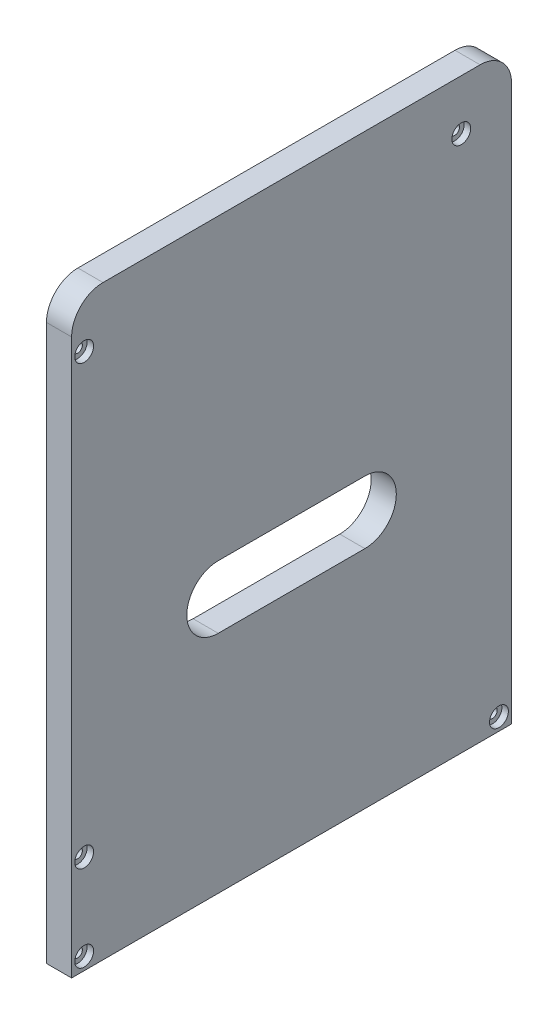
ISO-10303-21;
HEADER;
FILE_DESCRIPTION(('STEP AP214'),'2;1');
FILE_NAME('part.step','',(''),(''),'','','');
FILE_SCHEMA(('AUTOMOTIVE_DESIGN { 1 0 10303 214 1 1 1 1 }'));
ENDSEC;
DATA;
#1=APPLICATION_CONTEXT('core data for automotive mechanical design processes');
#2=APPLICATION_PROTOCOL_DEFINITION('international standard','automotive_design',2000,#1);
#3=PRODUCT_CONTEXT('',#1,'mechanical');
#4=PRODUCT('Part','Part','',(#3));
#5=PRODUCT_RELATED_PRODUCT_CATEGORY('part','',(#4));
#6=PRODUCT_DEFINITION_FORMATION('','',#4);
#7=PRODUCT_DEFINITION_CONTEXT('part definition',#1,'design');
#8=PRODUCT_DEFINITION('design','',#6,#7);
#9=PRODUCT_DEFINITION_SHAPE('','',#8);
#10=(LENGTH_UNIT() NAMED_UNIT(*) SI_UNIT(.MILLI.,.METRE.));
#11=(NAMED_UNIT(*) PLANE_ANGLE_UNIT() SI_UNIT($,.RADIAN.));
#12=(NAMED_UNIT(*) SI_UNIT($,.STERADIAN.) SOLID_ANGLE_UNIT());
#13=UNCERTAINTY_MEASURE_WITH_UNIT(LENGTH_MEASURE(1.E-05),#10,'distance_accuracy_value','');
#14=(GEOMETRIC_REPRESENTATION_CONTEXT(3) GLOBAL_UNCERTAINTY_ASSIGNED_CONTEXT((#13)) GLOBAL_UNIT_ASSIGNED_CONTEXT((#10,
#11,#12)) REPRESENTATION_CONTEXT('',''));
#15=CARTESIAN_POINT('',(0.,0.,0.));
#16=DIRECTION('',(0.,0.,1.));
#17=DIRECTION('',(1.,0.,0.));
#18=AXIS2_PLACEMENT_3D('',#15,#16,#17);
#19=CARTESIAN_POINT('',(228.,0.,0.));
#20=DIRECTION('',(-1.,0.,0.));
#21=DIRECTION('',(0.,0.,1.));
#22=AXIS2_PLACEMENT_3D('',#19,#20,#21);
#23=PLANE('',#22);
#24=CARTESIAN_POINT('',(228.,256.,99.));
#25=DIRECTION('',(-1.,0.,0.));
#26=DIRECTION('',(0.,0.,1.));
#27=AXIS2_PLACEMENT_3D('',#24,#25,#26);
#28=CIRCLE('',#27,2.24999999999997);
#29=CARTESIAN_POINT('',(228.,256.,101.25));
#30=VERTEX_POINT('',#29);
#31=EDGE_CURVE('E39',#30,#30,#28,.T.);
#32=ORIENTED_EDGE('',*,*,#31,.F.);
#33=EDGE_LOOP('',(#32));
#34=FACE_BOUND('',#33,.T.);
#35=CARTESIAN_POINT('',(228.,256.,-81.));
#36=DIRECTION('',(-1.,0.,0.));
#37=DIRECTION('',(0.,0.,1.));
#38=AXIS2_PLACEMENT_3D('',#35,#36,#37);
#39=CIRCLE('',#38,2.24999999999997);
#40=CARTESIAN_POINT('',(228.,256.,-78.7500000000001));
#41=VERTEX_POINT('',#40);
#42=EDGE_CURVE('E313',#41,#41,#39,.T.);
#43=ORIENTED_EDGE('',*,*,#42,.F.);
#44=EDGE_LOOP('',(#43));
#45=FACE_BOUND('',#44,.T.);
#46=CARTESIAN_POINT('',(228.,47.,98.9999999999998));
#47=DIRECTION('',(-1.,0.,0.));
#48=DIRECTION('',(0.,0.,1.));
#49=AXIS2_PLACEMENT_3D('',#46,#47,#48);
#50=CIRCLE('',#49,2.25);
#51=CARTESIAN_POINT('',(228.,47.,101.25));
#52=VERTEX_POINT('',#51);
#53=EDGE_CURVE('E309',#52,#52,#50,.T.);
#54=ORIENTED_EDGE('',*,*,#53,.F.);
#55=EDGE_LOOP('',(#54));
#56=FACE_BOUND('',#55,.T.);
#57=CARTESIAN_POINT('',(228.,6.,98.9999999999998));
#58=DIRECTION('',(-1.,0.,0.));
#59=DIRECTION('',(0.,0.,1.));
#60=AXIS2_PLACEMENT_3D('',#57,#58,#59);
#61=CIRCLE('',#60,2.25);
#62=CARTESIAN_POINT('',(228.,6.,101.25));
#63=VERTEX_POINT('',#62);
#64=EDGE_CURVE('E304',#63,#63,#61,.T.);
#65=ORIENTED_EDGE('',*,*,#64,.F.);
#66=EDGE_LOOP('',(#65));
#67=FACE_BOUND('',#66,.T.);
#68=CARTESIAN_POINT('',(228.,6.,-99.0000000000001));
#69=DIRECTION('',(-1.,0.,0.));
#70=DIRECTION('',(0.,0.,1.));
#71=AXIS2_PLACEMENT_3D('',#68,#69,#70);
#72=CIRCLE('',#71,2.25);
#73=CARTESIAN_POINT('',(228.,6.,-96.7500000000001));
#74=VERTEX_POINT('',#73);
#75=EDGE_CURVE('E300',#74,#74,#72,.T.);
#76=ORIENTED_EDGE('',*,*,#75,.F.);
#77=EDGE_LOOP('',(#76));
#78=FACE_BOUND('',#77,.T.);
#79=CARTESIAN_POINT('',(228.,122.5,34.9999999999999));
#80=DIRECTION('',(-1.,0.,0.));
#81=DIRECTION('',(0.,0.,1.));
#82=AXIS2_PLACEMENT_3D('',#79,#80,#81);
#83=CIRCLE('',#82,15.);
#84=CARTESIAN_POINT('',(228.,107.5,34.9999999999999));
#85=VERTEX_POINT('',#84);
#86=CARTESIAN_POINT('',(228.,137.5,34.9999999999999));
#87=VERTEX_POINT('',#86);
#88=EDGE_CURVE('E195',#85,#87,#83,.T.);
#89=ORIENTED_EDGE('',*,*,#88,.F.);
#90=DIRECTION('',(0.,0.,1.));
#91=VECTOR('',#90,1.);
#92=CARTESIAN_POINT('',(228.,107.5,0.));
#93=LINE('',#92,#91);
#94=CARTESIAN_POINT('',(228.,107.5,-35.0000000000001));
#95=VERTEX_POINT('',#94);
#96=EDGE_CURVE('E188',#95,#85,#93,.T.);
#97=ORIENTED_EDGE('',*,*,#96,.F.);
#98=CARTESIAN_POINT('',(228.,122.5,-35.0000000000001));
#99=DIRECTION('',(-1.,0.,0.));
#100=DIRECTION('',(0.,0.,1.));
#101=AXIS2_PLACEMENT_3D('',#98,#99,#100);
#102=CIRCLE('',#101,15.);
#103=CARTESIAN_POINT('',(228.,137.5,-35.0000000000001));
#104=VERTEX_POINT('',#103);
#105=EDGE_CURVE('E168',#104,#95,#102,.T.);
#106=ORIENTED_EDGE('',*,*,#105,.F.);
#107=DIRECTION('',(0.,0.,-1.));
#108=VECTOR('',#107,1.);
#109=CARTESIAN_POINT('',(228.,137.5,0.));
#110=LINE('',#109,#108);
#111=EDGE_CURVE('E193',#87,#104,#110,.T.);
#112=ORIENTED_EDGE('',*,*,#111,.F.);
#113=EDGE_LOOP('',(#89,#97,#106,#112));
#114=FACE_BOUND('',#113,.T.);
#115=CARTESIAN_POINT('',(228.,265.,-90.));
#116=DIRECTION('',(-1.,0.,0.));
#117=DIRECTION('',(0.,0.,1.));
#118=AXIS2_PLACEMENT_3D('',#115,#116,#117);
#119=CIRCLE('',#118,15.);
#120=CARTESIAN_POINT('',(228.,280.,-90.));
#121=VERTEX_POINT('',#120);
#122=CARTESIAN_POINT('',(228.,265.,-105.));
#123=VERTEX_POINT('',#122);
#124=EDGE_CURVE('E270',#121,#123,#119,.T.);
#125=ORIENTED_EDGE('',*,*,#124,.T.);
#126=DIRECTION('',(0.,1.,0.));
#127=VECTOR('',#126,1.);
#128=CARTESIAN_POINT('',(228.,0.,-105.));
#129=LINE('',#128,#127);
#130=CARTESIAN_POINT('',(228.,0.,-105.));
#131=VERTEX_POINT('',#130);
#132=EDGE_CURVE('E258',#131,#123,#129,.T.);
#133=ORIENTED_EDGE('',*,*,#132,.F.);
#134=DIRECTION('',(0.,0.,-1.));
#135=VECTOR('',#134,1.);
#136=CARTESIAN_POINT('',(228.,0.,105.));
#137=LINE('',#136,#135);
#138=CARTESIAN_POINT('',(228.,0.,105.));
#139=VERTEX_POINT('',#138);
#140=EDGE_CURVE('E256',#139,#131,#137,.T.);
#141=ORIENTED_EDGE('',*,*,#140,.F.);
#142=DIRECTION('',(0.,-1.,0.));
#143=VECTOR('',#142,1.);
#144=CARTESIAN_POINT('',(228.,0.,105.));
#145=LINE('',#144,#143);
#146=CARTESIAN_POINT('',(228.,265.,105.));
#147=VERTEX_POINT('',#146);
#148=EDGE_CURVE('E238',#147,#139,#145,.T.);
#149=ORIENTED_EDGE('',*,*,#148,.F.);
#150=CARTESIAN_POINT('',(228.,265.,90.));
#151=DIRECTION('',(-1.,0.,0.));
#152=DIRECTION('',(0.,0.,1.));
#153=AXIS2_PLACEMENT_3D('',#150,#151,#152);
#154=CIRCLE('',#153,15.);
#155=CARTESIAN_POINT('',(228.,280.,90.));
#156=VERTEX_POINT('',#155);
#157=EDGE_CURVE('E273',#147,#156,#154,.T.);
#158=ORIENTED_EDGE('',*,*,#157,.T.);
#159=DIRECTION('',(0.,0.,1.));
#160=VECTOR('',#159,1.);
#161=CARTESIAN_POINT('',(228.,280.,105.));
#162=LINE('',#161,#160);
#163=EDGE_CURVE('E246',#121,#156,#162,.T.);
#164=ORIENTED_EDGE('',*,*,#163,.F.);
#165=EDGE_LOOP('',(#125,#133,#141,#149,#158,#164));
#166=FACE_BOUND('',#165,.T.);
#167=DIRECTION('',(0.,0.,-1.));
#168=VECTOR('',#167,1.);
#169=CARTESIAN_POINT('',(228.,53.,0.));
#170=LINE('',#169,#168);
#171=CARTESIAN_POINT('',(228.,53.,93.));
#172=VERTEX_POINT('',#171);
#173=CARTESIAN_POINT('',(228.,53.,-85.));
#174=VERTEX_POINT('',#173);
#175=EDGE_CURVE('E291',#172,#174,#170,.T.);
#176=ORIENTED_EDGE('',*,*,#175,.T.);
#177=DIRECTION('',(0.,1.,0.));
#178=VECTOR('',#177,1.);
#179=CARTESIAN_POINT('',(228.,53.,-85.));
#180=LINE('',#179,#178);
#181=CARTESIAN_POINT('',(228.,65.,-85.));
#182=VERTEX_POINT('',#181);
#183=EDGE_CURVE('E235',#174,#182,#180,.T.);
#184=ORIENTED_EDGE('',*,*,#183,.T.);
#185=DIRECTION('',(0.,0.,-1.));
#186=VECTOR('',#185,1.);
#187=CARTESIAN_POINT('',(228.,65.,0.));
#188=LINE('',#187,#186);
#189=CARTESIAN_POINT('',(228.,65.,93.));
#190=VERTEX_POINT('',#189);
#191=EDGE_CURVE('E286',#190,#182,#188,.T.);
#192=ORIENTED_EDGE('',*,*,#191,.F.);
#193=DIRECTION('',(0.,1.,0.));
#194=VECTOR('',#193,1.);
#195=CARTESIAN_POINT('',(228.,0.,93.));
#196=LINE('',#195,#194);
#197=EDGE_CURVE('E288',#172,#190,#196,.T.);
#198=ORIENTED_EDGE('',*,*,#197,.F.);
#199=EDGE_LOOP('',(#176,#184,#192,#198));
#200=FACE_BOUND('',#199,.T.);
#201=DIRECTION('',(0.,1.,0.));
#202=VECTOR('',#201,1.);
#203=CARTESIAN_POINT('',(228.,0.,93.));
#204=LINE('',#203,#202);
#205=CARTESIAN_POINT('',(228.,210.,93.));
#206=VERTEX_POINT('',#205);
#207=CARTESIAN_POINT('',(228.,230.,93.));
#208=VERTEX_POINT('',#207);
#209=EDGE_CURVE('E296',#206,#208,#204,.T.);
#210=ORIENTED_EDGE('',*,*,#209,.F.);
#211=DIRECTION('',(0.,0.,-1.));
#212=VECTOR('',#211,1.);
#213=CARTESIAN_POINT('',(228.,210.,0.));
#214=LINE('',#213,#212);
#215=CARTESIAN_POINT('',(228.,210.,-75.));
#216=VERTEX_POINT('',#215);
#217=EDGE_CURVE('E11',#206,#216,#214,.T.);
#218=ORIENTED_EDGE('',*,*,#217,.T.);
#219=DIRECTION('',(0.,-1.,0.));
#220=VECTOR('',#219,1.);
#221=CARTESIAN_POINT('',(228.,0.,-75.));
#222=LINE('',#221,#220);
#223=CARTESIAN_POINT('',(228.,230.,-75.));
#224=VERTEX_POINT('',#223);
#225=EDGE_CURVE('E44',#224,#216,#222,.T.);
#226=ORIENTED_EDGE('',*,*,#225,.F.);
#227=DIRECTION('',(0.,0.,-1.));
#228=VECTOR('',#227,1.);
#229=CARTESIAN_POINT('',(228.,230.,0.));
#230=LINE('',#229,#228);
#231=EDGE_CURVE('E294',#208,#224,#230,.T.);
#232=ORIENTED_EDGE('',*,*,#231,.F.);
#233=EDGE_LOOP('',(#210,#218,#226,#232));
#234=FACE_BOUND('',#233,.T.);
#235=ADVANCED_FACE('F35',(#34,#45,#56,#67,#78,#114,#166,#200,#234),#23,.T.);
#236=CARTESIAN_POINT('',(240.,0.,105.));
#237=DIRECTION('',(0.,0.,-1.));
#238=DIRECTION('',(-1.,0.,0.));
#239=AXIS2_PLACEMENT_3D('',#236,#237,#238);
#240=PLANE('',#239);
#241=DIRECTION('',(0.,-1.,0.));
#242=VECTOR('',#241,1.);
#243=CARTESIAN_POINT('',(240.,0.,105.));
#244=LINE('',#243,#242);
#245=CARTESIAN_POINT('',(240.,265.,105.));
#246=VERTEX_POINT('',#245);
#247=CARTESIAN_POINT('',(240.,0.,105.));
#248=VERTEX_POINT('',#247);
#249=EDGE_CURVE('E243',#246,#248,#244,.T.);
#250=ORIENTED_EDGE('',*,*,#249,.F.);
#251=DIRECTION('',(-1.,0.,0.));
#252=VECTOR('',#251,1.);
#253=CARTESIAN_POINT('',(240.,265.,105.));
#254=LINE('',#253,#252);
#255=EDGE_CURVE('E267',#246,#147,#254,.T.);
#256=ORIENTED_EDGE('',*,*,#255,.T.);
#257=ORIENTED_EDGE('',*,*,#148,.T.);
#258=DIRECTION('',(-1.,0.,0.));
#259=VECTOR('',#258,1.);
#260=CARTESIAN_POINT('',(240.,0.,105.));
#261=LINE('',#260,#259);
#262=EDGE_CURVE('E264',#248,#139,#261,.T.);
#263=ORIENTED_EDGE('',*,*,#262,.F.);
#264=EDGE_LOOP('',(#250,#256,#257,#263));
#265=FACE_BOUND('',#264,.T.);
#266=ADVANCED_FACE('F384',(#265),#240,.F.);
#267=CARTESIAN_POINT('',(240.,0.,105.));
#268=DIRECTION('',(0.,1.,0.));
#269=DIRECTION('',(0.,0.,1.));
#270=AXIS2_PLACEMENT_3D('',#267,#268,#269);
#271=PLANE('',#270);
#272=ORIENTED_EDGE('',*,*,#140,.T.);
#273=DIRECTION('',(-1.,0.,0.));
#274=VECTOR('',#273,1.);
#275=CARTESIAN_POINT('',(240.,0.,-105.));
#276=LINE('',#275,#274);
#277=CARTESIAN_POINT('',(240.,0.,-105.));
#278=VERTEX_POINT('',#277);
#279=EDGE_CURVE('E254',#278,#131,#276,.T.);
#280=ORIENTED_EDGE('',*,*,#279,.F.);
#281=DIRECTION('',(0.,0.,-1.));
#282=VECTOR('',#281,1.);
#283=CARTESIAN_POINT('',(240.,0.,105.));
#284=LINE('',#283,#282);
#285=EDGE_CURVE('E245',#248,#278,#284,.T.);
#286=ORIENTED_EDGE('',*,*,#285,.F.);
#287=ORIENTED_EDGE('',*,*,#262,.T.);
#288=EDGE_LOOP('',(#272,#280,#286,#287));
#289=FACE_BOUND('',#288,.T.);
#290=ADVANCED_FACE('F389',(#289),#271,.F.);
#291=CARTESIAN_POINT('',(240.,0.,-105.));
#292=DIRECTION('',(0.,0.,1.));
#293=DIRECTION('',(1.,0.,0.));
#294=AXIS2_PLACEMENT_3D('',#291,#292,#293);
#295=PLANE('',#294);
#296=ORIENTED_EDGE('',*,*,#132,.T.);
#297=DIRECTION('',(-1.,0.,0.));
#298=VECTOR('',#297,1.);
#299=CARTESIAN_POINT('',(240.,265.,-105.));
#300=LINE('',#299,#298);
#301=CARTESIAN_POINT('',(240.,265.,-105.));
#302=VERTEX_POINT('',#301);
#303=EDGE_CURVE('E284',#123,#302,#300,.F.);
#304=ORIENTED_EDGE('',*,*,#303,.T.);
#305=DIRECTION('',(0.,1.,0.));
#306=VECTOR('',#305,1.);
#307=CARTESIAN_POINT('',(240.,0.,-105.));
#308=LINE('',#307,#306);
#309=EDGE_CURVE('E248',#278,#302,#308,.T.);
#310=ORIENTED_EDGE('',*,*,#309,.F.);
#311=ORIENTED_EDGE('',*,*,#279,.T.);
#312=EDGE_LOOP('',(#296,#304,#310,#311));
#313=FACE_BOUND('',#312,.T.);
#314=ADVANCED_FACE('F376',(#313),#295,.F.);
#315=CARTESIAN_POINT('',(240.,280.,105.));
#316=DIRECTION('',(0.,-1.,0.));
#317=DIRECTION('',(0.,0.,-1.));
#318=AXIS2_PLACEMENT_3D('',#315,#316,#317);
#319=PLANE('',#318);
#320=ORIENTED_EDGE('',*,*,#163,.T.);
#321=DIRECTION('',(-1.,0.,0.));
#322=VECTOR('',#321,1.);
#323=CARTESIAN_POINT('',(240.,280.,90.));
#324=LINE('',#323,#322);
#325=CARTESIAN_POINT('',(240.,280.,90.));
#326=VERTEX_POINT('',#325);
#327=EDGE_CURVE('E278',#156,#326,#324,.F.);
#328=ORIENTED_EDGE('',*,*,#327,.T.);
#329=DIRECTION('',(0.,0.,1.));
#330=VECTOR('',#329,1.);
#331=CARTESIAN_POINT('',(240.,280.,105.));
#332=LINE('',#331,#330);
#333=CARTESIAN_POINT('',(240.,280.,-90.));
#334=VERTEX_POINT('',#333);
#335=EDGE_CURVE('E251',#334,#326,#332,.T.);
#336=ORIENTED_EDGE('',*,*,#335,.F.);
#337=DIRECTION('',(-1.,0.,0.));
#338=VECTOR('',#337,1.);
#339=CARTESIAN_POINT('',(240.,280.,-90.));
#340=LINE('',#339,#338);
#341=EDGE_CURVE('E275',#334,#121,#340,.T.);
#342=ORIENTED_EDGE('',*,*,#341,.T.);
#343=EDGE_LOOP('',(#320,#328,#336,#342));
#344=FACE_BOUND('',#343,.T.);
#345=ADVANCED_FACE('F368',(#344),#319,.F.);
#346=CARTESIAN_POINT('',(240.,0.,0.));
#347=DIRECTION('',(-1.,0.,0.));
#348=DIRECTION('',(0.,0.,1.));
#349=AXIS2_PLACEMENT_3D('',#346,#347,#348);
#350=PLANE('',#349);
#351=CARTESIAN_POINT('',(240.,256.,99.));
#352=DIRECTION('',(1.,0.,0.));
#353=DIRECTION('',(0.,0.,-1.));
#354=AXIS2_PLACEMENT_3D('',#351,#352,#353);
#355=CIRCLE('',#354,4.5);
#356=CARTESIAN_POINT('',(240.,256.,94.5));
#357=VERTEX_POINT('',#356);
#358=EDGE_CURVE('E562',#357,#357,#355,.T.);
#359=ORIENTED_EDGE('',*,*,#358,.F.);
#360=EDGE_LOOP('',(#359));
#361=FACE_BOUND('',#360,.T.);
#362=CARTESIAN_POINT('',(240.,256.,-81.));
#363=DIRECTION('',(1.,0.,0.));
#364=DIRECTION('',(0.,0.,-1.));
#365=AXIS2_PLACEMENT_3D('',#362,#363,#364);
#366=CIRCLE('',#365,4.5);
#367=CARTESIAN_POINT('',(240.,256.,-85.5));
#368=VERTEX_POINT('',#367);
#369=EDGE_CURVE('E328',#368,#368,#366,.T.);
#370=ORIENTED_EDGE('',*,*,#369,.F.);
#371=EDGE_LOOP('',(#370));
#372=FACE_BOUND('',#371,.T.);
#373=CARTESIAN_POINT('',(240.,47.,98.9999999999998));
#374=DIRECTION('',(1.,0.,0.));
#375=DIRECTION('',(0.,0.,-1.));
#376=AXIS2_PLACEMENT_3D('',#373,#374,#375);
#377=CIRCLE('',#376,4.5);
#378=CARTESIAN_POINT('',(240.,47.,94.4999999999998));
#379=VERTEX_POINT('',#378);
#380=EDGE_CURVE('E315',#379,#379,#377,.T.);
#381=ORIENTED_EDGE('',*,*,#380,.F.);
#382=EDGE_LOOP('',(#381));
#383=FACE_BOUND('',#382,.T.);
#384=CARTESIAN_POINT('',(240.,6.,98.9999999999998));
#385=DIRECTION('',(1.,0.,0.));
#386=DIRECTION('',(0.,0.,-1.));
#387=AXIS2_PLACEMENT_3D('',#384,#385,#386);
#388=CIRCLE('',#387,4.5);
#389=CARTESIAN_POINT('',(240.,6.,94.4999999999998));
#390=VERTEX_POINT('',#389);
#391=EDGE_CURVE('E311',#390,#390,#388,.T.);
#392=ORIENTED_EDGE('',*,*,#391,.F.);
#393=EDGE_LOOP('',(#392));
#394=FACE_BOUND('',#393,.T.);
#395=CARTESIAN_POINT('',(240.,6.,-99.0000000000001));
#396=DIRECTION('',(1.,0.,0.));
#397=DIRECTION('',(0.,0.,-1.));
#398=AXIS2_PLACEMENT_3D('',#395,#396,#397);
#399=CIRCLE('',#398,4.5);
#400=CARTESIAN_POINT('',(240.,6.,-103.5));
#401=VERTEX_POINT('',#400);
#402=EDGE_CURVE('E307',#401,#401,#399,.T.);
#403=ORIENTED_EDGE('',*,*,#402,.F.);
#404=EDGE_LOOP('',(#403));
#405=FACE_BOUND('',#404,.T.);
#406=DIRECTION('',(0.,0.,-1.));
#407=VECTOR('',#406,1.);
#408=CARTESIAN_POINT('',(240.,107.5,34.9999999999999));
#409=LINE('',#408,#407);
#410=CARTESIAN_POINT('',(240.,107.5,35.0000000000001));
#411=VERTEX_POINT('',#410);
#412=CARTESIAN_POINT('',(240.,107.5,-35.0000000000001));
#413=VERTEX_POINT('',#412);
#414=EDGE_CURVE('E174',#411,#413,#409,.T.);
#415=ORIENTED_EDGE('',*,*,#414,.F.);
#416=CARTESIAN_POINT('',(240.,122.5,34.9999999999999));
#417=DIRECTION('',(1.,0.,0.));
#418=DIRECTION('',(0.,0.,-1.));
#419=AXIS2_PLACEMENT_3D('',#416,#417,#418);
#420=CIRCLE('',#419,15.);
#421=CARTESIAN_POINT('',(240.,137.5,34.9999999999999));
#422=VERTEX_POINT('',#421);
#423=EDGE_CURVE('E60',#422,#411,#420,.T.);
#424=ORIENTED_EDGE('',*,*,#423,.F.);
#425=DIRECTION('',(0.,0.,1.));
#426=VECTOR('',#425,1.);
#427=CARTESIAN_POINT('',(240.,137.5,34.9999999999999));
#428=LINE('',#427,#426);
#429=CARTESIAN_POINT('',(240.,137.5,-35.0000000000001));
#430=VERTEX_POINT('',#429);
#431=EDGE_CURVE('E181',#430,#422,#428,.T.);
#432=ORIENTED_EDGE('',*,*,#431,.F.);
#433=CARTESIAN_POINT('',(240.,122.5,-35.0000000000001));
#434=DIRECTION('',(1.,0.,0.));
#435=DIRECTION('',(0.,0.,-1.));
#436=AXIS2_PLACEMENT_3D('',#433,#434,#435);
#437=CIRCLE('',#436,15.);
#438=EDGE_CURVE('E165',#413,#430,#437,.T.);
#439=ORIENTED_EDGE('',*,*,#438,.F.);
#440=EDGE_LOOP('',(#415,#424,#432,#439));
#441=FACE_BOUND('',#440,.T.);
#442=ORIENTED_EDGE('',*,*,#335,.T.);
#443=CARTESIAN_POINT('',(240.,265.,90.));
#444=DIRECTION('',(-1.,0.,0.));
#445=DIRECTION('',(0.,0.,1.));
#446=AXIS2_PLACEMENT_3D('',#443,#444,#445);
#447=CIRCLE('',#446,15.);
#448=EDGE_CURVE('E282',#326,#246,#447,.F.);
#449=ORIENTED_EDGE('',*,*,#448,.T.);
#450=ORIENTED_EDGE('',*,*,#249,.T.);
#451=ORIENTED_EDGE('',*,*,#285,.T.);
#452=ORIENTED_EDGE('',*,*,#309,.T.);
#453=CARTESIAN_POINT('',(240.,265.,-90.));
#454=DIRECTION('',(-1.,0.,0.));
#455=DIRECTION('',(0.,0.,1.));
#456=AXIS2_PLACEMENT_3D('',#453,#454,#455);
#457=CIRCLE('',#456,15.);
#458=EDGE_CURVE('E280',#302,#334,#457,.F.);
#459=ORIENTED_EDGE('',*,*,#458,.T.);
#460=EDGE_LOOP('',(#442,#449,#450,#451,#452,#459));
#461=FACE_BOUND('',#460,.T.);
#462=ADVANCED_FACE('F178',(#361,#372,#383,#394,#405,#441,#461),#350,.F.);
#463=CARTESIAN_POINT('',(240.,265.,90.));
#464=DIRECTION('',(-1.,0.,0.));
#465=DIRECTION('',(0.,0.,1.));
#466=AXIS2_PLACEMENT_3D('',#463,#464,#465);
#467=CYLINDRICAL_SURFACE('',#466,15.);
#468=ORIENTED_EDGE('',*,*,#448,.F.);
#469=ORIENTED_EDGE('',*,*,#327,.F.);
#470=ORIENTED_EDGE('',*,*,#157,.F.);
#471=ORIENTED_EDGE('',*,*,#255,.F.);
#472=EDGE_LOOP('',(#468,#469,#470,#471));
#473=FACE_BOUND('',#472,.T.);
#474=ADVANCED_FACE('F367',(#473),#467,.T.);
#475=CARTESIAN_POINT('',(240.,265.,-90.));
#476=DIRECTION('',(-1.,0.,0.));
#477=DIRECTION('',(0.,0.,1.));
#478=AXIS2_PLACEMENT_3D('',#475,#476,#477);
#479=CYLINDRICAL_SURFACE('',#478,15.);
#480=ORIENTED_EDGE('',*,*,#458,.F.);
#481=ORIENTED_EDGE('',*,*,#303,.F.);
#482=ORIENTED_EDGE('',*,*,#124,.F.);
#483=ORIENTED_EDGE('',*,*,#341,.F.);
#484=EDGE_LOOP('',(#480,#481,#482,#483));
#485=FACE_BOUND('',#484,.T.);
#486=ADVANCED_FACE('F37',(#485),#479,.T.);
#487=CARTESIAN_POINT('',(231.,53.,-85.));
#488=DIRECTION('',(0.,0.,-1.));
#489=DIRECTION('',(-1.,0.,0.));
#490=AXIS2_PLACEMENT_3D('',#487,#488,#489);
#491=PLANE('',#490);
#492=DIRECTION('',(-1.,0.,0.));
#493=VECTOR('',#492,1.);
#494=CARTESIAN_POINT('',(231.,65.,-85.));
#495=LINE('',#494,#493);
#496=CARTESIAN_POINT('',(231.,65.,-85.));
#497=VERTEX_POINT('',#496);
#498=EDGE_CURVE('E222',#497,#182,#495,.T.);
#499=ORIENTED_EDGE('',*,*,#498,.T.);
#500=ORIENTED_EDGE('',*,*,#183,.F.);
#501=DIRECTION('',(-1.,0.,0.));
#502=VECTOR('',#501,1.);
#503=CARTESIAN_POINT('',(231.,53.,-85.));
#504=LINE('',#503,#502);
#505=CARTESIAN_POINT('',(231.,53.,-85.));
#506=VERTEX_POINT('',#505);
#507=EDGE_CURVE('E225',#506,#174,#504,.T.);
#508=ORIENTED_EDGE('',*,*,#507,.F.);
#509=DIRECTION('',(0.,1.,0.));
#510=VECTOR('',#509,1.);
#511=CARTESIAN_POINT('',(231.,53.,-85.));
#512=LINE('',#511,#510);
#513=EDGE_CURVE('E239',#506,#497,#512,.T.);
#514=ORIENTED_EDGE('',*,*,#513,.T.);
#515=EDGE_LOOP('',(#499,#500,#508,#514));
#516=FACE_BOUND('',#515,.T.);
#517=ADVANCED_FACE('F422',(#516),#491,.F.);
#518=CARTESIAN_POINT('',(231.,53.,93.));
#519=DIRECTION('',(1.,0.,0.));
#520=DIRECTION('',(0.,1.,0.));
#521=AXIS2_PLACEMENT_3D('',#518,#519,#520);
#522=PLANE('',#521);
#523=DIRECTION('',(0.,0.,-1.));
#524=VECTOR('',#523,1.);
#525=CARTESIAN_POINT('',(231.,65.,93.));
#526=LINE('',#525,#524);
#527=CARTESIAN_POINT('',(231.,65.,93.));
#528=VERTEX_POINT('',#527);
#529=EDGE_CURVE('E230',#528,#497,#526,.T.);
#530=ORIENTED_EDGE('',*,*,#529,.T.);
#531=ORIENTED_EDGE('',*,*,#513,.F.);
#532=DIRECTION('',(0.,0.,-1.));
#533=VECTOR('',#532,1.);
#534=CARTESIAN_POINT('',(231.,53.,93.));
#535=LINE('',#534,#533);
#536=CARTESIAN_POINT('',(231.,53.,93.));
#537=VERTEX_POINT('',#536);
#538=EDGE_CURVE('E221',#537,#506,#535,.T.);
#539=ORIENTED_EDGE('',*,*,#538,.F.);
#540=DIRECTION('',(0.,1.,0.));
#541=VECTOR('',#540,1.);
#542=CARTESIAN_POINT('',(231.,53.,93.));
#543=LINE('',#542,#541);
#544=EDGE_CURVE('E228',#537,#528,#543,.T.);
#545=ORIENTED_EDGE('',*,*,#544,.T.);
#546=EDGE_LOOP('',(#530,#531,#539,#545));
#547=FACE_BOUND('',#546,.T.);
#548=ADVANCED_FACE('F426',(#547),#522,.F.);
#549=CARTESIAN_POINT('',(57.,53.,93.));
#550=DIRECTION('',(0.,0.,1.));
#551=DIRECTION('',(1.,0.,0.));
#552=AXIS2_PLACEMENT_3D('',#549,#550,#551);
#553=PLANE('',#552);
#554=ORIENTED_EDGE('',*,*,#197,.T.);
#555=DIRECTION('',(1.,0.,0.));
#556=VECTOR('',#555,1.);
#557=CARTESIAN_POINT('',(57.,65.,93.));
#558=LINE('',#557,#556);
#559=EDGE_CURVE('E216',#190,#528,#558,.T.);
#560=ORIENTED_EDGE('',*,*,#559,.T.);
#561=ORIENTED_EDGE('',*,*,#544,.F.);
#562=DIRECTION('',(1.,0.,0.));
#563=VECTOR('',#562,1.);
#564=CARTESIAN_POINT('',(57.,53.,93.));
#565=LINE('',#564,#563);
#566=EDGE_CURVE('E219',#172,#537,#565,.T.);
#567=ORIENTED_EDGE('',*,*,#566,.F.);
#568=EDGE_LOOP('',(#554,#560,#561,#567));
#569=FACE_BOUND('',#568,.T.);
#570=ADVANCED_FACE('F432',(#569),#553,.F.);
#571=CARTESIAN_POINT('',(0.,53.,0.));
#572=DIRECTION('',(0.,1.,0.));
#573=DIRECTION('',(-1.,0.,0.));
#574=AXIS2_PLACEMENT_3D('',#571,#572,#573);
#575=PLANE('',#574);
#576=ORIENTED_EDGE('',*,*,#566,.T.);
#577=ORIENTED_EDGE('',*,*,#538,.T.);
#578=ORIENTED_EDGE('',*,*,#507,.T.);
#579=ORIENTED_EDGE('',*,*,#175,.F.);
#580=EDGE_LOOP('',(#576,#577,#578,#579));
#581=FACE_BOUND('',#580,.T.);
#582=ADVANCED_FACE('F439',(#581),#575,.T.);
#583=CARTESIAN_POINT('',(0.,65.,0.));
#584=DIRECTION('',(0.,1.,0.));
#585=DIRECTION('',(-1.,0.,0.));
#586=AXIS2_PLACEMENT_3D('',#583,#584,#585);
#587=PLANE('',#586);
#588=ORIENTED_EDGE('',*,*,#191,.T.);
#589=ORIENTED_EDGE('',*,*,#498,.F.);
#590=ORIENTED_EDGE('',*,*,#529,.F.);
#591=ORIENTED_EDGE('',*,*,#559,.F.);
#592=EDGE_LOOP('',(#588,#589,#590,#591));
#593=FACE_BOUND('',#592,.T.);
#594=ADVANCED_FACE('F436',(#593),#587,.F.);
#595=CARTESIAN_POINT('',(231.,210.,-75.));
#596=DIRECTION('',(0.,0.,-1.));
#597=DIRECTION('',(-1.,0.,0.));
#598=AXIS2_PLACEMENT_3D('',#595,#596,#597);
#599=PLANE('',#598);
#600=ORIENTED_EDGE('',*,*,#225,.T.);
#601=DIRECTION('',(-1.,0.,0.));
#602=VECTOR('',#601,1.);
#603=CARTESIAN_POINT('',(231.,210.,-75.));
#604=LINE('',#603,#602);
#605=CARTESIAN_POINT('',(231.,210.,-75.));
#606=VERTEX_POINT('',#605);
#607=EDGE_CURVE('E204',#606,#216,#604,.T.);
#608=ORIENTED_EDGE('',*,*,#607,.F.);
#609=DIRECTION('',(0.,1.,0.));
#610=VECTOR('',#609,1.);
#611=CARTESIAN_POINT('',(231.,210.,-75.));
#612=LINE('',#611,#610);
#613=CARTESIAN_POINT('',(231.,230.,-75.));
#614=VERTEX_POINT('',#613);
#615=EDGE_CURVE('E214',#606,#614,#612,.T.);
#616=ORIENTED_EDGE('',*,*,#615,.T.);
#617=DIRECTION('',(-1.,0.,0.));
#618=VECTOR('',#617,1.);
#619=CARTESIAN_POINT('',(231.,230.,-75.));
#620=LINE('',#619,#618);
#621=EDGE_CURVE('E201',#614,#224,#620,.T.);
#622=ORIENTED_EDGE('',*,*,#621,.T.);
#623=EDGE_LOOP('',(#600,#608,#616,#622));
#624=FACE_BOUND('',#623,.T.);
#625=ADVANCED_FACE('F456',(#624),#599,.F.);
#626=CARTESIAN_POINT('',(231.,210.,93.));
#627=DIRECTION('',(1.,0.,0.));
#628=DIRECTION('',(0.,0.,-1.));
#629=AXIS2_PLACEMENT_3D('',#626,#627,#628);
#630=PLANE('',#629);
#631=DIRECTION('',(0.,0.,-1.));
#632=VECTOR('',#631,1.);
#633=CARTESIAN_POINT('',(231.,230.,93.));
#634=LINE('',#633,#632);
#635=CARTESIAN_POINT('',(231.,230.,93.));
#636=VERTEX_POINT('',#635);
#637=EDGE_CURVE('E209',#636,#614,#634,.T.);
#638=ORIENTED_EDGE('',*,*,#637,.T.);
#639=ORIENTED_EDGE('',*,*,#615,.F.);
#640=DIRECTION('',(0.,0.,-1.));
#641=VECTOR('',#640,1.);
#642=CARTESIAN_POINT('',(231.,210.,93.));
#643=LINE('',#642,#641);
#644=CARTESIAN_POINT('',(231.,210.,93.));
#645=VERTEX_POINT('',#644);
#646=EDGE_CURVE('E200',#645,#606,#643,.T.);
#647=ORIENTED_EDGE('',*,*,#646,.F.);
#648=DIRECTION('',(0.,1.,0.));
#649=VECTOR('',#648,1.);
#650=CARTESIAN_POINT('',(231.,210.,93.));
#651=LINE('',#650,#649);
#652=EDGE_CURVE('E207',#645,#636,#651,.T.);
#653=ORIENTED_EDGE('',*,*,#652,.T.);
#654=EDGE_LOOP('',(#638,#639,#647,#653));
#655=FACE_BOUND('',#654,.T.);
#656=ADVANCED_FACE('F460',(#655),#630,.F.);
#657=CARTESIAN_POINT('',(57.,210.,93.));
#658=DIRECTION('',(0.,0.,1.));
#659=DIRECTION('',(1.,0.,0.));
#660=AXIS2_PLACEMENT_3D('',#657,#658,#659);
#661=PLANE('',#660);
#662=ORIENTED_EDGE('',*,*,#209,.T.);
#663=DIRECTION('',(1.,0.,0.));
#664=VECTOR('',#663,1.);
#665=CARTESIAN_POINT('',(57.,230.,93.));
#666=LINE('',#665,#664);
#667=EDGE_CURVE('E197',#208,#636,#666,.T.);
#668=ORIENTED_EDGE('',*,*,#667,.T.);
#669=ORIENTED_EDGE('',*,*,#652,.F.);
#670=DIRECTION('',(1.,0.,0.));
#671=VECTOR('',#670,1.);
#672=CARTESIAN_POINT('',(57.,210.,93.));
#673=LINE('',#672,#671);
#674=EDGE_CURVE('E198',#206,#645,#673,.T.);
#675=ORIENTED_EDGE('',*,*,#674,.F.);
#676=EDGE_LOOP('',(#662,#668,#669,#675));
#677=FACE_BOUND('',#676,.T.);
#678=ADVANCED_FACE('F466',(#677),#661,.F.);
#679=CARTESIAN_POINT('',(0.,210.,0.));
#680=DIRECTION('',(0.,1.,0.));
#681=DIRECTION('',(0.,0.,1.));
#682=AXIS2_PLACEMENT_3D('',#679,#680,#681);
#683=PLANE('',#682);
#684=ORIENTED_EDGE('',*,*,#674,.T.);
#685=ORIENTED_EDGE('',*,*,#646,.T.);
#686=ORIENTED_EDGE('',*,*,#607,.T.);
#687=ORIENTED_EDGE('',*,*,#217,.F.);
#688=EDGE_LOOP('',(#684,#685,#686,#687));
#689=FACE_BOUND('',#688,.T.);
#690=ADVANCED_FACE('F474',(#689),#683,.T.);
#691=CARTESIAN_POINT('',(0.,230.,0.));
#692=DIRECTION('',(0.,1.,0.));
#693=DIRECTION('',(0.,0.,1.));
#694=AXIS2_PLACEMENT_3D('',#691,#692,#693);
#695=PLANE('',#694);
#696=ORIENTED_EDGE('',*,*,#231,.T.);
#697=ORIENTED_EDGE('',*,*,#621,.F.);
#698=ORIENTED_EDGE('',*,*,#637,.F.);
#699=ORIENTED_EDGE('',*,*,#667,.F.);
#700=EDGE_LOOP('',(#696,#697,#698,#699));
#701=FACE_BOUND('',#700,.T.);
#702=ADVANCED_FACE('F470',(#701),#695,.F.);
#703=CARTESIAN_POINT('',(-240.,122.5,35.0000000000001));
#704=DIRECTION('',(1.,0.,0.));
#705=DIRECTION('',(0.,0.,-1.));
#706=AXIS2_PLACEMENT_3D('',#703,#704,#705);
#707=CYLINDRICAL_SURFACE('',#706,15.);
#708=ORIENTED_EDGE('',*,*,#88,.T.);
#709=DIRECTION('',(1.,0.,0.));
#710=VECTOR('',#709,1.);
#711=CARTESIAN_POINT('',(-240.,137.5,35.0000000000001));
#712=LINE('',#711,#710);
#713=EDGE_CURVE('E186',#87,#422,#712,.T.);
#714=ORIENTED_EDGE('',*,*,#713,.T.);
#715=ORIENTED_EDGE('',*,*,#423,.T.);
#716=DIRECTION('',(1.,0.,0.));
#717=VECTOR('',#716,1.);
#718=CARTESIAN_POINT('',(-240.,107.5,35.0000000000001));
#719=LINE('',#718,#717);
#720=EDGE_CURVE('E171',#85,#411,#719,.T.);
#721=ORIENTED_EDGE('',*,*,#720,.F.);
#722=EDGE_LOOP('',(#708,#714,#715,#721));
#723=FACE_BOUND('',#722,.T.);
#724=ADVANCED_FACE('F491',(#723),#707,.F.);
#725=CARTESIAN_POINT('',(-240.,137.5,35.0000000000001));
#726=DIRECTION('',(0.,1.,0.));
#727=DIRECTION('',(0.,0.,1.));
#728=AXIS2_PLACEMENT_3D('',#725,#726,#727);
#729=PLANE('',#728);
#730=ORIENTED_EDGE('',*,*,#111,.T.);
#731=DIRECTION('',(1.,0.,0.));
#732=VECTOR('',#731,1.);
#733=CARTESIAN_POINT('',(-240.,137.5,-34.9999999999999));
#734=LINE('',#733,#732);
#735=EDGE_CURVE('E170',#104,#430,#734,.T.);
#736=ORIENTED_EDGE('',*,*,#735,.T.);
#737=ORIENTED_EDGE('',*,*,#431,.T.);
#738=ORIENTED_EDGE('',*,*,#713,.F.);
#739=EDGE_LOOP('',(#730,#736,#737,#738));
#740=FACE_BOUND('',#739,.T.);
#741=ADVANCED_FACE('F495',(#740),#729,.F.);
#742=CARTESIAN_POINT('',(-240.,122.5,-34.9999999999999));
#743=DIRECTION('',(1.,0.,0.));
#744=DIRECTION('',(0.,0.,-1.));
#745=AXIS2_PLACEMENT_3D('',#742,#743,#744);
#746=CYLINDRICAL_SURFACE('',#745,15.);
#747=ORIENTED_EDGE('',*,*,#105,.T.);
#748=DIRECTION('',(1.,0.,0.));
#749=VECTOR('',#748,1.);
#750=CARTESIAN_POINT('',(-240.,107.5,-34.9999999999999));
#751=LINE('',#750,#749);
#752=EDGE_CURVE('E52',#95,#413,#751,.T.);
#753=ORIENTED_EDGE('',*,*,#752,.T.);
#754=ORIENTED_EDGE('',*,*,#438,.T.);
#755=ORIENTED_EDGE('',*,*,#735,.F.);
#756=EDGE_LOOP('',(#747,#753,#754,#755));
#757=FACE_BOUND('',#756,.T.);
#758=ADVANCED_FACE('F162',(#757),#746,.F.);
#759=CARTESIAN_POINT('',(-240.,107.5,35.0000000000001));
#760=DIRECTION('',(0.,-1.,0.));
#761=DIRECTION('',(0.,0.,-1.));
#762=AXIS2_PLACEMENT_3D('',#759,#760,#761);
#763=PLANE('',#762);
#764=ORIENTED_EDGE('',*,*,#96,.T.);
#765=ORIENTED_EDGE('',*,*,#720,.T.);
#766=ORIENTED_EDGE('',*,*,#414,.T.);
#767=ORIENTED_EDGE('',*,*,#752,.F.);
#768=EDGE_LOOP('',(#764,#765,#766,#767));
#769=FACE_BOUND('',#768,.T.);
#770=ADVANCED_FACE('F175',(#769),#763,.F.);
#771=CARTESIAN_POINT('',(240.,6.,-99.0000000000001));
#772=DIRECTION('',(1.,0.,0.));
#773=DIRECTION('',(0.,0.,-1.));
#774=AXIS2_PLACEMENT_3D('',#771,#772,#773);
#775=CYLINDRICAL_SURFACE('',#774,2.25);
#776=ORIENTED_EDGE('',*,*,#75,.T.);
#777=EDGE_LOOP('',(#776));
#778=FACE_BOUND('',#777,.T.);
#779=CARTESIAN_POINT('',(236.9,6.,-99.0000000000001));
#780=DIRECTION('',(1.,0.,0.));
#781=DIRECTION('',(0.,0.,-1.));
#782=AXIS2_PLACEMENT_3D('',#779,#780,#781);
#783=CIRCLE('',#782,2.25);
#784=CARTESIAN_POINT('',(236.9,6.,-101.25));
#785=VERTEX_POINT('',#784);
#786=EDGE_CURVE('E303',#785,#785,#783,.T.);
#787=ORIENTED_EDGE('',*,*,#786,.T.);
#788=EDGE_LOOP('',(#787));
#789=FACE_BOUND('',#788,.T.);
#790=ADVANCED_FACE('F351',(#778,#789),#775,.F.);
#791=CARTESIAN_POINT('',(236.9,8.25,-99.0000000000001));
#792=DIRECTION('',(-1.,0.,0.));
#793=DIRECTION('',(0.,0.,1.));
#794=AXIS2_PLACEMENT_3D('',#791,#792,#793);
#795=PLANE('',#794);
#796=ORIENTED_EDGE('',*,*,#786,.F.);
#797=EDGE_LOOP('',(#796));
#798=FACE_BOUND('',#797,.T.);
#799=CARTESIAN_POINT('',(236.9,6.,-99.0000000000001));
#800=DIRECTION('',(1.,0.,0.));
#801=DIRECTION('',(0.,0.,-1.));
#802=AXIS2_PLACEMENT_3D('',#799,#800,#801);
#803=CIRCLE('',#802,4.5);
#804=CARTESIAN_POINT('',(236.9,6.,-103.5));
#805=VERTEX_POINT('',#804);
#806=EDGE_CURVE('E345',#805,#805,#803,.T.);
#807=ORIENTED_EDGE('',*,*,#806,.T.);
#808=EDGE_LOOP('',(#807));
#809=FACE_BOUND('',#808,.T.);
#810=ADVANCED_FACE('F353',(#798,#809),#795,.F.);
#811=CARTESIAN_POINT('',(240.,6.,-99.0000000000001));
#812=DIRECTION('',(1.,0.,0.));
#813=DIRECTION('',(0.,0.,-1.));
#814=AXIS2_PLACEMENT_3D('',#811,#812,#813);
#815=CYLINDRICAL_SURFACE('',#814,4.5);
#816=ORIENTED_EDGE('',*,*,#806,.F.);
#817=EDGE_LOOP('',(#816));
#818=FACE_BOUND('',#817,.T.);
#819=ORIENTED_EDGE('',*,*,#402,.T.);
#820=EDGE_LOOP('',(#819));
#821=FACE_BOUND('',#820,.T.);
#822=ADVANCED_FACE('F356',(#818,#821),#815,.F.);
#823=CARTESIAN_POINT('',(240.,6.,98.9999999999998));
#824=DIRECTION('',(1.,0.,0.));
#825=DIRECTION('',(0.,0.,-1.));
#826=AXIS2_PLACEMENT_3D('',#823,#824,#825);
#827=CYLINDRICAL_SURFACE('',#826,2.25);
#828=ORIENTED_EDGE('',*,*,#64,.T.);
#829=EDGE_LOOP('',(#828));
#830=FACE_BOUND('',#829,.T.);
#831=CARTESIAN_POINT('',(236.9,6.,98.9999999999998));
#832=DIRECTION('',(1.,0.,0.));
#833=DIRECTION('',(0.,0.,-1.));
#834=AXIS2_PLACEMENT_3D('',#831,#832,#833);
#835=CIRCLE('',#834,2.25);
#836=CARTESIAN_POINT('',(236.9,6.,96.7499999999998));
#837=VERTEX_POINT('',#836);
#838=EDGE_CURVE('E308',#837,#837,#835,.T.);
#839=ORIENTED_EDGE('',*,*,#838,.T.);
#840=EDGE_LOOP('',(#839));
#841=FACE_BOUND('',#840,.T.);
#842=ADVANCED_FACE('F362',(#830,#841),#827,.F.);
#843=CARTESIAN_POINT('',(236.9,8.25,98.9999999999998));
#844=DIRECTION('',(-1.,0.,0.));
#845=DIRECTION('',(0.,0.,1.));
#846=AXIS2_PLACEMENT_3D('',#843,#844,#845);
#847=PLANE('',#846);
#848=ORIENTED_EDGE('',*,*,#838,.F.);
#849=EDGE_LOOP('',(#848));
#850=FACE_BOUND('',#849,.T.);
#851=CARTESIAN_POINT('',(236.9,6.,98.9999999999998));
#852=DIRECTION('',(1.,0.,0.));
#853=DIRECTION('',(0.,0.,-1.));
#854=AXIS2_PLACEMENT_3D('',#851,#852,#853);
#855=CIRCLE('',#854,4.5);
#856=CARTESIAN_POINT('',(236.9,6.,94.4999999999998));
#857=VERTEX_POINT('',#856);
#858=EDGE_CURVE('E338',#857,#857,#855,.T.);
#859=ORIENTED_EDGE('',*,*,#858,.T.);
#860=EDGE_LOOP('',(#859));
#861=FACE_BOUND('',#860,.T.);
#862=ADVANCED_FACE('F512',(#850,#861),#847,.F.);
#863=CARTESIAN_POINT('',(240.,6.,98.9999999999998));
#864=DIRECTION('',(1.,0.,0.));
#865=DIRECTION('',(0.,0.,-1.));
#866=AXIS2_PLACEMENT_3D('',#863,#864,#865);
#867=CYLINDRICAL_SURFACE('',#866,4.5);
#868=ORIENTED_EDGE('',*,*,#858,.F.);
#869=EDGE_LOOP('',(#868));
#870=FACE_BOUND('',#869,.T.);
#871=ORIENTED_EDGE('',*,*,#391,.T.);
#872=EDGE_LOOP('',(#871));
#873=FACE_BOUND('',#872,.T.);
#874=ADVANCED_FACE('F516',(#870,#873),#867,.F.);
#875=CARTESIAN_POINT('',(240.,47.,98.9999999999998));
#876=DIRECTION('',(1.,0.,0.));
#877=DIRECTION('',(0.,0.,-1.));
#878=AXIS2_PLACEMENT_3D('',#875,#876,#877);
#879=CYLINDRICAL_SURFACE('',#878,2.25);
#880=ORIENTED_EDGE('',*,*,#53,.T.);
#881=EDGE_LOOP('',(#880));
#882=FACE_BOUND('',#881,.T.);
#883=CARTESIAN_POINT('',(236.9,47.,98.9999999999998));
#884=DIRECTION('',(1.,0.,0.));
#885=DIRECTION('',(0.,0.,-1.));
#886=AXIS2_PLACEMENT_3D('',#883,#884,#885);
#887=CIRCLE('',#886,2.25);
#888=CARTESIAN_POINT('',(236.9,47.,96.7499999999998));
#889=VERTEX_POINT('',#888);
#890=EDGE_CURVE('E312',#889,#889,#887,.T.);
#891=ORIENTED_EDGE('',*,*,#890,.T.);
#892=EDGE_LOOP('',(#891));
#893=FACE_BOUND('',#892,.T.);
#894=ADVANCED_FACE('F520',(#882,#893),#879,.F.);
#895=CARTESIAN_POINT('',(236.9,49.25,98.9999999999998));
#896=DIRECTION('',(-1.,0.,0.));
#897=DIRECTION('',(0.,0.,1.));
#898=AXIS2_PLACEMENT_3D('',#895,#896,#897);
#899=PLANE('',#898);
#900=ORIENTED_EDGE('',*,*,#890,.F.);
#901=EDGE_LOOP('',(#900));
#902=FACE_BOUND('',#901,.T.);
#903=CARTESIAN_POINT('',(236.9,47.,98.9999999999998));
#904=DIRECTION('',(1.,0.,0.));
#905=DIRECTION('',(0.,0.,-1.));
#906=AXIS2_PLACEMENT_3D('',#903,#904,#905);
#907=CIRCLE('',#906,4.5);
#908=CARTESIAN_POINT('',(236.9,47.,94.4999999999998));
#909=VERTEX_POINT('',#908);
#910=EDGE_CURVE('E320',#909,#909,#907,.T.);
#911=ORIENTED_EDGE('',*,*,#910,.T.);
#912=EDGE_LOOP('',(#911));
#913=FACE_BOUND('',#912,.T.);
#914=ADVANCED_FACE('F524',(#902,#913),#899,.F.);
#915=CARTESIAN_POINT('',(240.,47.,98.9999999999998));
#916=DIRECTION('',(1.,0.,0.));
#917=DIRECTION('',(0.,0.,-1.));
#918=AXIS2_PLACEMENT_3D('',#915,#916,#917);
#919=CYLINDRICAL_SURFACE('',#918,4.5);
#920=ORIENTED_EDGE('',*,*,#910,.F.);
#921=EDGE_LOOP('',(#920));
#922=FACE_BOUND('',#921,.T.);
#923=ORIENTED_EDGE('',*,*,#380,.T.);
#924=EDGE_LOOP('',(#923));
#925=FACE_BOUND('',#924,.T.);
#926=ADVANCED_FACE('F528',(#922,#925),#919,.F.);
#927=CARTESIAN_POINT('',(240.,256.,-81.));
#928=DIRECTION('',(1.,0.,0.));
#929=DIRECTION('',(0.,0.,-1.));
#930=AXIS2_PLACEMENT_3D('',#927,#928,#929);
#931=CYLINDRICAL_SURFACE('',#930,2.24999999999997);
#932=ORIENTED_EDGE('',*,*,#42,.T.);
#933=EDGE_LOOP('',(#932));
#934=FACE_BOUND('',#933,.T.);
#935=CARTESIAN_POINT('',(236.9,256.,-81.));
#936=DIRECTION('',(1.,0.,0.));
#937=DIRECTION('',(0.,0.,-1.));
#938=AXIS2_PLACEMENT_3D('',#935,#936,#937);
#939=CIRCLE('',#938,2.24999999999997);
#940=CARTESIAN_POINT('',(236.9,256.,-83.25));
#941=VERTEX_POINT('',#940);
#942=EDGE_CURVE('E316',#941,#941,#939,.T.);
#943=ORIENTED_EDGE('',*,*,#942,.T.);
#944=EDGE_LOOP('',(#943));
#945=FACE_BOUND('',#944,.T.);
#946=ADVANCED_FACE('F532',(#934,#945),#931,.F.);
#947=CARTESIAN_POINT('',(236.9,258.25,-81.));
#948=DIRECTION('',(-1.,0.,0.));
#949=DIRECTION('',(0.,0.,1.));
#950=AXIS2_PLACEMENT_3D('',#947,#948,#949);
#951=PLANE('',#950);
#952=ORIENTED_EDGE('',*,*,#942,.F.);
#953=EDGE_LOOP('',(#952));
#954=FACE_BOUND('',#953,.T.);
#955=CARTESIAN_POINT('',(236.9,256.,-81.));
#956=DIRECTION('',(1.,0.,0.));
#957=DIRECTION('',(0.,0.,-1.));
#958=AXIS2_PLACEMENT_3D('',#955,#956,#957);
#959=CIRCLE('',#958,4.5);
#960=CARTESIAN_POINT('',(236.9,256.,-85.5));
#961=VERTEX_POINT('',#960);
#962=EDGE_CURVE('E323',#961,#961,#959,.T.);
#963=ORIENTED_EDGE('',*,*,#962,.T.);
#964=EDGE_LOOP('',(#963));
#965=FACE_BOUND('',#964,.T.);
#966=ADVANCED_FACE('F536',(#954,#965),#951,.F.);
#967=CARTESIAN_POINT('',(240.,256.,-81.));
#968=DIRECTION('',(1.,0.,0.));
#969=DIRECTION('',(0.,0.,-1.));
#970=AXIS2_PLACEMENT_3D('',#967,#968,#969);
#971=CYLINDRICAL_SURFACE('',#970,4.5);
#972=ORIENTED_EDGE('',*,*,#962,.F.);
#973=EDGE_LOOP('',(#972));
#974=FACE_BOUND('',#973,.T.);
#975=ORIENTED_EDGE('',*,*,#369,.T.);
#976=EDGE_LOOP('',(#975));
#977=FACE_BOUND('',#976,.T.);
#978=ADVANCED_FACE('F539',(#974,#977),#971,.F.);
#979=CARTESIAN_POINT('',(240.,256.,99.));
#980=DIRECTION('',(1.,0.,0.));
#981=DIRECTION('',(0.,0.,-1.));
#982=AXIS2_PLACEMENT_3D('',#979,#980,#981);
#983=CYLINDRICAL_SURFACE('',#982,2.24999999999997);
#984=ORIENTED_EDGE('',*,*,#31,.T.);
#985=EDGE_LOOP('',(#984));
#986=FACE_BOUND('',#985,.T.);
#987=CARTESIAN_POINT('',(236.9,256.,99.));
#988=DIRECTION('',(1.,0.,0.));
#989=DIRECTION('',(0.,0.,-1.));
#990=AXIS2_PLACEMENT_3D('',#987,#988,#989);
#991=CIRCLE('',#990,2.24999999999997);
#992=CARTESIAN_POINT('',(236.9,256.,96.75));
#993=VERTEX_POINT('',#992);
#994=EDGE_CURVE('E564',#993,#993,#991,.T.);
#995=ORIENTED_EDGE('',*,*,#994,.T.);
#996=EDGE_LOOP('',(#995));
#997=FACE_BOUND('',#996,.T.);
#998=ADVANCED_FACE('F543',(#986,#997),#983,.F.);
#999=CARTESIAN_POINT('',(236.9,258.25,99.));
#1000=DIRECTION('',(-1.,0.,0.));
#1001=DIRECTION('',(0.,0.,1.));
#1002=AXIS2_PLACEMENT_3D('',#999,#1000,#1001);
#1003=PLANE('',#1002);
#1004=ORIENTED_EDGE('',*,*,#994,.F.);
#1005=EDGE_LOOP('',(#1004));
#1006=FACE_BOUND('',#1005,.T.);
#1007=CARTESIAN_POINT('',(236.9,256.,99.));
#1008=DIRECTION('',(1.,0.,0.));
#1009=DIRECTION('',(0.,0.,-1.));
#1010=AXIS2_PLACEMENT_3D('',#1007,#1008,#1009);
#1011=CIRCLE('',#1010,4.5);
#1012=CARTESIAN_POINT('',(236.9,256.,94.5));
#1013=VERTEX_POINT('',#1012);
#1014=EDGE_CURVE('E560',#1013,#1013,#1011,.T.);
#1015=ORIENTED_EDGE('',*,*,#1014,.T.);
#1016=EDGE_LOOP('',(#1015));
#1017=FACE_BOUND('',#1016,.T.);
#1018=ADVANCED_FACE('F547',(#1006,#1017),#1003,.F.);
#1019=CARTESIAN_POINT('',(240.,256.,99.));
#1020=DIRECTION('',(1.,0.,0.));
#1021=DIRECTION('',(0.,0.,-1.));
#1022=AXIS2_PLACEMENT_3D('',#1019,#1020,#1021);
#1023=CYLINDRICAL_SURFACE('',#1022,4.5);
#1024=ORIENTED_EDGE('',*,*,#1014,.F.);
#1025=EDGE_LOOP('',(#1024));
#1026=FACE_BOUND('',#1025,.T.);
#1027=ORIENTED_EDGE('',*,*,#358,.T.);
#1028=EDGE_LOOP('',(#1027));
#1029=FACE_BOUND('',#1028,.T.);
#1030=ADVANCED_FACE('F551',(#1026,#1029),#1023,.F.);
#1031=CLOSED_SHELL('',(#235,#266,#290,#314,#345,#462,#474,#486,#517,#548,#570,#582,#594,#625,
#656,#678,#690,#702,#724,#741,#758,#770,#790,#810,#822,#842,#862,#874,#894,#914,#926,#946,#966,
#978,#998,#1018,#1030));
#1032=MANIFOLD_SOLID_BREP('B2',#1031);
#1033=ADVANCED_BREP_SHAPE_REPRESENTATION('',(#18,#1032),#14);
#1034=SHAPE_DEFINITION_REPRESENTATION(#9,#1033);
ENDSEC;
END-ISO-10303-21;
